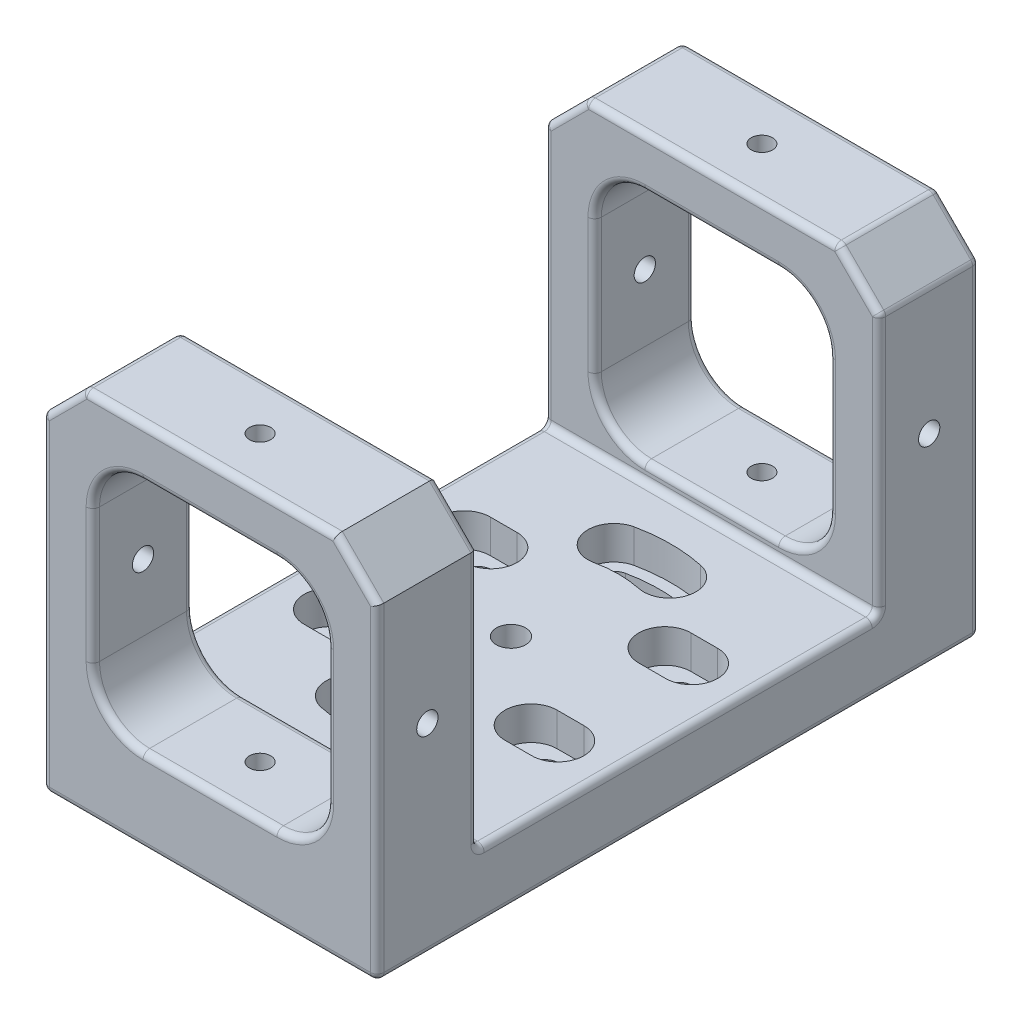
from build123d import *

# Parameters (mm, degrees)
FRONT_HOLDER_DEPTH     = 19.05
SKETCH7_W              = 63.5
SKETCH7_H              = 12.7
BASE_DEPTH             = 76.2
LPATTERN1_COUNT        = 2
LPATTERN1_PITCH        = 95.25
SKETCH11_R             = 2.77876
MOUNTING_HOLES_DEPTH   = 12.7
EXTRUDE1_DEPTH         = 6.35
F_10_32_TAPPED_HOLE1_D = 4.0386
CIRPATTERN1_COUNT      = 4
MIRROR4_COPY_1_D       = 4.0386
MIRROR4_COPY_2_D       = 4.0386
MIRROR4_COPY_3_D       = 4.0386
CUT_EXTRUDE1_DEPTH     = 6.35
SKETCH22_R             = 2.794
CUT_EXTRUDE2_DEPTH     = 135.554087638
LPATTERN2_COUNT        = 2
LPATTERN2_PITCH        = 25.4
LPATTERN2_COUNT_DIR2   = 2
LPATTERN2_PITCH_DIR2   = 38.1
FILLET14_R             = 1.27


with BuildPart() as part:
    # Sketch1 → front holder (new body)
    with BuildSketch(Plane.XY):
        Polygon((-31.75, 0), (31.75, 0), (31.75, 61.976), (23.876, 69.85), (-23.876, 69.85), (-31.75, 61.976), align=None)
        with BuildLine():
            Line((-22.225, 50.8), (-22.225, 25.4))
            ThreePointArc((-22.225, 25.4), (-19.435192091, 18.664807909), (-12.7, 15.875))
            Line((-12.7, 15.875), (12.7, 15.875))
            ThreePointArc((12.7, 15.875), (19.435192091, 18.664807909), (22.225, 25.4))
            Line((22.225, 25.4), (22.225, 50.8))
            ThreePointArc((22.225, 50.8), (19.435192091, 57.535192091), (12.7, 60.325))
            Line((12.7, 60.325), (-12.7, 60.325))
            ThreePointArc((-12.7, 60.325), (-19.435192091, 57.535192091), (-22.225, 50.8))
        make_face(mode=Mode.SUBTRACT)
    front_holder = extrude(amount=FRONT_HOLDER_DEPTH)

    # Sketch7 → base (add)
    with BuildSketch(Plane.XY.offset(19.05)):
        with Locations((0, 6.35)):
            Rectangle(SKETCH7_W, SKETCH7_H)
    extrude(amount=BASE_DEPTH)

    # LPattern1: front holder ×2
    with Locations(*[(0, 0, i * LPATTERN1_PITCH) for i in range(1, LPATTERN1_COUNT)]):
        add(front_holder)

    # Sketch11 → mounting holes (cut)
    with BuildSketch(Plane(origin=(0, 12.7, 0), x_dir=(-1, 0, 0), z_dir=(0, 1, 0))):
        with Locations(Location((0, 57.15, 0), (0, 0, 90))):
            Circle(SKETCH11_R)
        with BuildLine():
            ThreePointArc((4.700051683, 79.262004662), (8.013901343, 81.414043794), (5.861862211, 84.727893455))
            ThreePointArc((5.861862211, 84.727893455), (0, 85.344), (-5.861862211, 84.727893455))
            ThreePointArc((-5.861862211, 84.727893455), (-8.013901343, 81.414043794), (-4.700051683, 79.262004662))
            ThreePointArc((-4.700051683, 79.262004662), (0, 79.756), (4.700051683, 79.262004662))
        make_face()
        with BuildLine():
            ThreePointArc((-4.700051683, 35.037995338), (-8.013901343, 32.885956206), (-5.861862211, 29.572106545))
            ThreePointArc((-5.861862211, 29.572106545), (0, 28.956), (5.861862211, 29.572106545))
            ThreePointArc((5.861862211, 29.572106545), (8.013901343, 32.885956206), (4.700051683, 35.037995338))
            ThreePointArc((4.700051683, 35.037995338), (0, 34.544), (-4.700051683, 35.037995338))
        make_face()
    extrude(amount=-MOUNTING_HOLES_DEPTH, mode=Mode.SUBTRACT)

    # Sketch17 → Extrude1 (cut)
    with BuildSketch(Plane(origin=(0, 12.7, 0), x_dir=(1, 0, 0), z_dir=(0, 1, 0))):
        with BuildLine():
            ThreePointArc((-4.251170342, -77.150183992), (0, -77.597), (4.251170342, -77.150183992))
            ThreePointArc((4.251170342, -77.150183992), (10.125722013, -80.965162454), (6.310743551, -86.839714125))
            ThreePointArc((6.310743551, -86.839714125), (0, -87.503), (-6.310743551, -86.839714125))
            ThreePointArc((-6.310743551, -86.839714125), (-10.125722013, -80.965162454), (-4.251170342, -77.150183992))
        make_face()
    extrude1 = extrude(amount=-EXTRUDE1_DEPTH, mode=Mode.SUBTRACT)

    # Mirror3: Extrude1 across plane
    add(extrude1.mirror(Plane(origin=(0, 0, 57.15), x_dir=(1, 0, 0), z_dir=(0, 0, -1))), mode=Mode.SUBTRACT)

    # 10-32 Tapped Hole1 (through all)
    with Locations(Plane(origin=(0, 69.85, 0), x_dir=(-1, 0, 0), z_dir=(0, 1, 0))):
        with Locations((0, 104.775)):
            f_10_32_tapped_hole1 = Hole(F_10_32_TAPPED_HOLE1_D / 2)

    # CirPattern1: 10-32 Tapped Hole1 ×4 about axis
    cirpattern1_axis = Axis((0, 38.1, -5.715), (0, 0, 1))
    for i in range(1, CIRPATTERN1_COUNT):
        add(f_10_32_tapped_hole1.rotate(cirpattern1_axis, i * 360 / CIRPATTERN1_COUNT), mode=Mode.SUBTRACT)

    # Mirror4: 10-32 Tapped Hole1 across plane
    add(f_10_32_tapped_hole1.mirror(Plane(origin=(0, 0, 57.15), x_dir=(1, 0, 0), z_dir=(0, 0, -1))), mode=Mode.SUBTRACT)

    # Mirror4 copy 1 (through all)
    with Locations(Plane(origin=(-31.75, 38.1, 114.3), x_dir=(0, -1, 0), z_dir=(-1, 0, 0))):
        with Locations((0, -104.775)):
            Hole(MIRROR4_COPY_1_D / 2)

    # Mirror4 copy 2 (through all)
    with Locations(Plane(origin=(0, 6.35, 114.3), x_dir=(1, 0, 0), z_dir=(0, -1, 0))):
        with Locations((0, -104.775)):
            Hole(MIRROR4_COPY_2_D / 2)

    # Mirror4 copy 3 (through all)
    with Locations(Plane(origin=(31.75, 38.1, 114.3), x_dir=(0, 1, 0), z_dir=(1, 0, 0))):
        with Locations((0, -104.775)):
            Hole(MIRROR4_COPY_3_D / 2)

    # Sketch21 → Cut-Extrude1 (cut)
    with BuildSketch(Plane(origin=(0, 12.7, 0), x_dir=(1, 0, 0), z_dir=(0, 1, 0))):
        with BuildLine():
            Line((21.59, -39.497), (16.51, -39.497))
            ThreePointArc((16.51, -39.497), (11.557, -44.45), (16.51, -49.403))
            Line((16.51, -49.403), (21.59, -49.403))
            ThreePointArc((21.59, -49.403), (26.543, -44.45), (21.59, -39.497))
        make_face()
    cut_extrude1 = extrude(amount=-CUT_EXTRUDE1_DEPTH, mode=Mode.SUBTRACT)

    # Sketch22 → Cut-Extrude2 (cut, through all)
    with BuildSketch(Plane(origin=(0, 6.35, 0), x_dir=(1, 0, 0), z_dir=(0, 1, 0))):
        with Locations(Location((19.05, -44.45, 0), (0, 0, 270))):
            Circle(SKETCH22_R)
    cut_extrude2 = extrude(amount=-CUT_EXTRUDE2_DEPTH, mode=Mode.SUBTRACT)

    # LPattern2: Cut-Extrude1, Cut-Extrude2 2 × 2
    with Locations(*[(-j * LPATTERN2_PITCH_DIR2, 0, i * LPATTERN2_PITCH) for i in range(LPATTERN2_COUNT) for j in range(LPATTERN2_COUNT_DIR2) if (i, j) != (0, 0)]):
        add(cut_extrude1, mode=Mode.SUBTRACT)
        add(cut_extrude2, mode=Mode.SUBTRACT)

    # Fillet14
    fillet14_edges = [part.edges().sort_by_distance(p)[0] for p in [
        (31.75, 12.7, 57.15),
        (-31.75, 12.7, 57.15),
        (19.435192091, 18.664807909, 0),
        (0, 15.875, 0),
        (-19.435192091, 18.664807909, 0),
        (-22.225, 38.1, 0),
        (-19.435192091, 57.535192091, 0),
        (0, 60.325, 0),
        (19.435192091, 57.535192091, 0),
        (-19.435192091, 57.535192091, 114.3),
        (0, 60.325, 114.3),
        (19.435192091, 57.535192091, 114.3),
        (22.225, 38.1, 114.3),
        (19.435192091, 18.664807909, 114.3),
        (0, 15.875, 114.3),
        (-19.435192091, 18.664807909, 114.3),
        (-22.225, 38.1, 19.05),
        (-19.435192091, 57.535192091, 19.05),
        (0, 60.325, 19.05),
        (19.435192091, 57.535192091, 19.05),
        (22.225, 38.1, 19.05),
        (19.435192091, 18.664807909, 19.05),
        (0, 15.875, 19.05),
        (22.225, 38.1, 95.25),
        (19.435192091, 18.664807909, 95.25),
        (0, 15.875, 95.25),
        (-19.435192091, 18.664807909, 95.25),
        (-22.225, 38.1, 95.25),
        (-19.435192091, 57.535192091, 95.25),
        (0, 60.325, 95.25),
        (19.435192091, 57.535192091, 95.25),
        (27.813, 65.913, 95.25),
        (0, 69.85, 95.25),
        (-27.813, 65.913, 95.25),
        (-31.75, 37.338, 95.25),
        (0, 12.7, 95.25),
        (31.75, 37.338, 95.25),
        (22.225, 38.1, 0),
        (0, 0, 0),
        (0, 0, 114.3),
        (31.75, 0, 57.15),
        (31.75, 30.988, 114.3),
        (27.813, 65.913, 114.3),
        (-22.225, 38.1, 114.3),
        (0, 69.85, 114.3),
        (-27.813, 65.913, 114.3),
        (-31.75, 61.976, 104.775),
        (-23.876, 69.85, 104.775),
        (-31.75, 0, 57.15),
        (-31.75, 30.988, 114.3),
        (-19.435192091, 18.664807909, 19.05),
        (0, 12.7, 19.05),
        (31.75, 37.338, 19.05),
        (27.813, 65.913, 19.05),
        (0, 69.85, 19.05),
        (-31.75, 37.338, 19.05),
        (-27.813, 65.913, 19.05),
        (-31.75, 61.976, 9.525),
        (-23.876, 69.85, 9.525),
        (31.75, 61.976, 9.525),
        (23.876, 69.85, 9.525),
        (31.75, 30.988, 0),
        (27.813, 65.913, 0),
        (0, 69.85, 0),
        (-27.813, 65.913, 0),
        (-31.75, 30.988, 0),
    ]]
    fillet(fillet14_edges, radius=FILLET14_R)


solid = part.part
